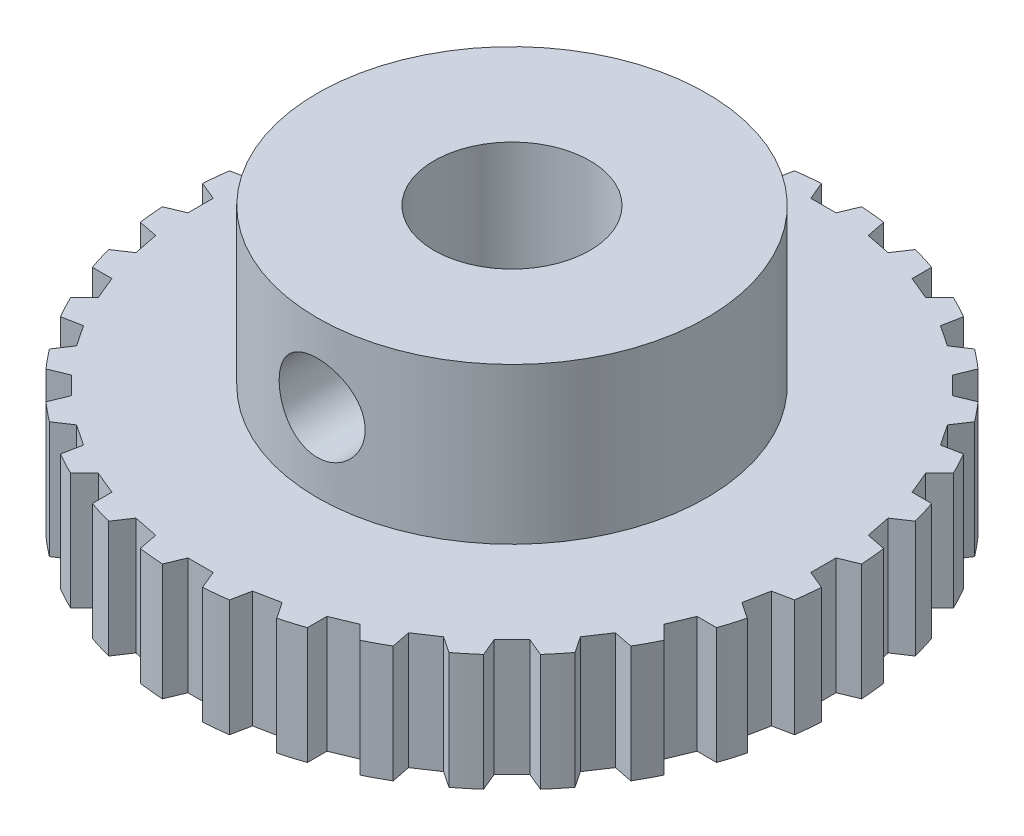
from build123d import *

# Parameters (mm, degrees)
SKETCH1_R          = 13.462
SKETCH1_R_2        = 3.175
EXTRUDE1_DEPTH     = 4.7625
SKETCH2_R          = 7.9375
SKETCH2_R_2        = 3.175
EXTRUDE2_DEPTH     = 6.35
CUT_EXTRUDE1_REACH = 24.044
CIRPATTERN1_COUNT  = 32
SKETCH4_W          = 1.7526
SKETCH4_H          = 13.437025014


with BuildPart() as part:
    # Sketch1 → Extrude1 (new body)
    with BuildSketch(Plane(origin=(0, 0, 0), x_dir=(1, 0, 0), z_dir=(0, 1, 0))):
        with Locations(Location((0, 0, 0), (0, 0, 90))):
            Circle(SKETCH1_R)
        with Locations(Location((0, 0, 0), (0, 0, 90))):
            Circle(SKETCH1_R_2, mode=Mode.SUBTRACT)
    extrude(amount=EXTRUDE1_DEPTH)

    # Sketch2 → Extrude2 (add)
    with BuildSketch(Plane(origin=(0, 4.7625, 0), x_dir=(1, 0, 0), z_dir=(0, 1, 0))):
        with Locations(Location((0, 0, 0), (0, 0, 270))):
            Circle(SKETCH2_R)
        with Locations(Location((0, 0, 0), (0, 0, 90))):
            Circle(SKETCH2_R_2, mode=Mode.SUBTRACT)
    extrude(amount=EXTRUDE2_DEPTH)

    # Sketch3 → Cut-Extrude1 (cut, up to next)
    with BuildSketch(Plane.XZ, mode=Mode.PRIVATE) as cut_extrude1_sk1:
        Polygon((-13.652339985, -0.908822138), (-13.652339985, 0.908822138), (-12.7, 0.51435), (-12.7, -0.51435), align=None)
    cut_extrude1_tool1 = extrude(cut_extrude1_sk1.sketch, amount=-CUT_EXTRUDE1_REACH, mode=Mode.PRIVATE) & part.part
    cut_extrude1 = cut_extrude1_tool1.solids().sort_by_distance((-13.220165, 0, 0))[0]
    add(cut_extrude1, mode=Mode.SUBTRACT)

    # CirPattern1: Cut-Extrude1 ×32 about axis
    cirpattern1_axis = Axis((0, 0, 0), (0, 1, 0))
    for i in range(1, CIRPATTERN1_COUNT):
        add(cut_extrude1.rotate(cirpattern1_axis, i * 360 / CIRPATTERN1_COUNT), mode=Mode.SUBTRACT)

    # Sketch4 → 6-32 Tapped Hole1 (revolve, cut)
    with BuildSketch(Plane(origin=(0, 7.9375, 0), x_dir=(0, 1, 0), z_dir=(1, 0, 0))):
        with Locations((0.8763, 6.718512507)):
            Rectangle(SKETCH4_W, SKETCH4_H)
    revolve(axis=Axis((0, 7.9375, -6.35), (0, 0, 1)), mode=Mode.SUBTRACT)


solid = part.part
